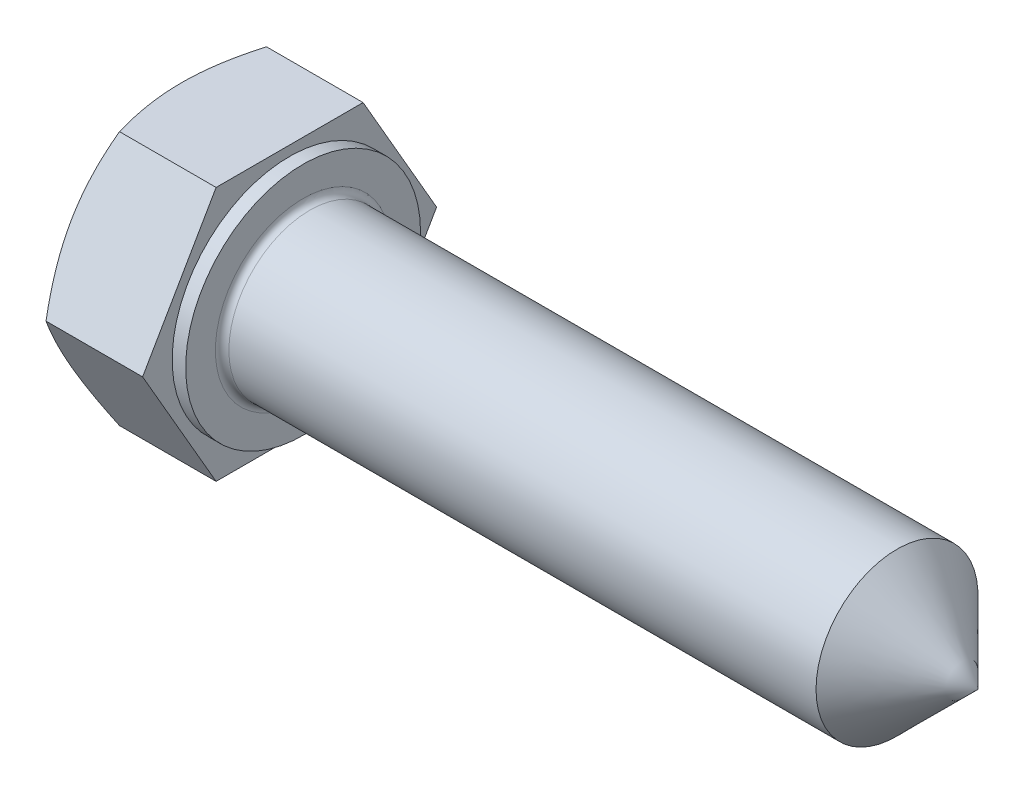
ISO-10303-21;
HEADER;
FILE_DESCRIPTION(('STEP AP214'),'2;1');
FILE_NAME('part.step','',(''),(''),'','','');
FILE_SCHEMA(('AUTOMOTIVE_DESIGN { 1 0 10303 214 1 1 1 1 }'));
ENDSEC;
DATA;
#1=APPLICATION_CONTEXT('core data for automotive mechanical design processes');
#2=APPLICATION_PROTOCOL_DEFINITION('international standard','automotive_design',2000,#1);
#3=PRODUCT_CONTEXT('',#1,'mechanical');
#4=PRODUCT('Part','Part','',(#3));
#5=PRODUCT_RELATED_PRODUCT_CATEGORY('part','',(#4));
#6=PRODUCT_DEFINITION_FORMATION('','',#4);
#7=PRODUCT_DEFINITION_CONTEXT('part definition',#1,'design');
#8=PRODUCT_DEFINITION('design','',#6,#7);
#9=PRODUCT_DEFINITION_SHAPE('','',#8);
#10=(LENGTH_UNIT() NAMED_UNIT(*) SI_UNIT(.MILLI.,.METRE.));
#11=(NAMED_UNIT(*) PLANE_ANGLE_UNIT() SI_UNIT($,.RADIAN.));
#12=(NAMED_UNIT(*) SI_UNIT($,.STERADIAN.) SOLID_ANGLE_UNIT());
#13=UNCERTAINTY_MEASURE_WITH_UNIT(LENGTH_MEASURE(1.E-05),#10,'distance_accuracy_value','');
#14=(GEOMETRIC_REPRESENTATION_CONTEXT(3) GLOBAL_UNCERTAINTY_ASSIGNED_CONTEXT((#13)) GLOBAL_UNIT_ASSIGNED_CONTEXT((#10,
#11,#12)) REPRESENTATION_CONTEXT('',''));
#15=CARTESIAN_POINT('',(0.,0.,0.));
#16=DIRECTION('',(0.,0.,1.));
#17=DIRECTION('',(1.,0.,0.));
#18=AXIS2_PLACEMENT_3D('',#15,#16,#17);
#19=CARTESIAN_POINT('',(29.5000000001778,0.,0.));
#20=DIRECTION('',(-1.,0.,0.));
#21=DIRECTION('',(0.,0.,1.));
#22=AXIS2_PLACEMENT_3D('',#19,#20,#21);
#23=CYLINDRICAL_SURFACE('',#22,3.);
#24=CARTESIAN_POINT('',(4.75000000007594,0.,0.));
#25=DIRECTION('',(1.,0.,0.));
#26=DIRECTION('',(0.,0.,-1.));
#27=AXIS2_PLACEMENT_3D('',#24,#25,#26);
#28=CIRCLE('',#27,3.);
#29=CARTESIAN_POINT('',(4.75000000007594,0.,-3.));
#30=VERTEX_POINT('',#29);
#31=EDGE_CURVE('E51',#30,#30,#28,.T.);
#32=ORIENTED_EDGE('',*,*,#31,.T.);
#33=EDGE_LOOP('',(#32));
#34=FACE_BOUND('',#33,.T.);
#35=CARTESIAN_POINT('',(26.5000000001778,0.,0.));
#36=DIRECTION('',(-1.,0.,0.));
#37=DIRECTION('',(0.,0.,1.));
#38=AXIS2_PLACEMENT_3D('',#35,#36,#37);
#39=CIRCLE('',#38,3.);
#40=CARTESIAN_POINT('',(26.5000000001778,0.,3.));
#41=VERTEX_POINT('',#40);
#42=EDGE_CURVE('E123',#41,#41,#39,.F.);
#43=ORIENTED_EDGE('',*,*,#42,.F.);
#44=EDGE_LOOP('',(#43));
#45=FACE_BOUND('',#44,.T.);
#46=ADVANCED_FACE('F43',(#34,#45),#23,.T.);
#47=CARTESIAN_POINT('',(4.50000000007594,0.,0.));
#48=DIRECTION('',(1.,0.,0.));
#49=DIRECTION('',(0.,0.,-1.));
#50=AXIS2_PLACEMENT_3D('',#47,#48,#49);
#51=PLANE('',#50);
#52=CARTESIAN_POINT('',(4.50000000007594,0.,0.));
#53=DIRECTION('',(1.,0.,0.));
#54=DIRECTION('',(0.,0.,-1.));
#55=AXIS2_PLACEMENT_3D('',#52,#53,#54);
#56=CIRCLE('',#55,3.25);
#57=CARTESIAN_POINT('',(4.50000000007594,0.,-3.25));
#58=VERTEX_POINT('',#57);
#59=EDGE_CURVE('E11',#58,#58,#56,.F.);
#60=ORIENTED_EDGE('',*,*,#59,.T.);
#61=EDGE_LOOP('',(#60));
#62=FACE_BOUND('',#61,.T.);
#63=CARTESIAN_POINT('',(4.50000000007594,0.,0.));
#64=DIRECTION('',(1.,0.,0.));
#65=DIRECTION('',(0.,0.,-1.));
#66=AXIS2_PLACEMENT_3D('',#63,#64,#65);
#67=CIRCLE('',#66,4.35);
#68=CARTESIAN_POINT('',(4.50000000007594,0.,-4.35));
#69=VERTEX_POINT('',#68);
#70=EDGE_CURVE('E183',#69,#69,#67,.T.);
#71=ORIENTED_EDGE('',*,*,#70,.T.);
#72=EDGE_LOOP('',(#71));
#73=FACE_BOUND('',#72,.T.);
#74=ADVANCED_FACE('F265',(#62,#73),#51,.T.);
#75=CARTESIAN_POINT('',(4.,-4.71550832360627,8.1675));
#76=DIRECTION('',(1.,0.,0.));
#77=DIRECTION('',(0.,0.,-1.));
#78=AXIS2_PLACEMENT_3D('',#75,#76,#77);
#79=PLANE('',#78);
#80=DIRECTION('',(0.,-0.866025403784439,0.5));
#81=VECTOR('',#80,1.);
#82=CARTESIAN_POINT('',(4.,4.71550832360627,2.7225));
#83=LINE('',#82,#81);
#84=CARTESIAN_POINT('',(4.,4.71550832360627,2.7225));
#85=VERTEX_POINT('',#84);
#86=CARTESIAN_POINT('',(4.,0.,5.445));
#87=VERTEX_POINT('',#86);
#88=EDGE_CURVE('E178',#85,#87,#83,.T.);
#89=ORIENTED_EDGE('',*,*,#88,.T.);
#90=DIRECTION('',(0.,-0.866025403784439,-0.5));
#91=VECTOR('',#90,1.);
#92=CARTESIAN_POINT('',(4.,0.,5.445));
#93=LINE('',#92,#91);
#94=CARTESIAN_POINT('',(4.,-4.71550832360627,2.7225));
#95=VERTEX_POINT('',#94);
#96=EDGE_CURVE('E176',#87,#95,#93,.T.);
#97=ORIENTED_EDGE('',*,*,#96,.T.);
#98=DIRECTION('',(0.,0.,-1.));
#99=VECTOR('',#98,1.);
#100=CARTESIAN_POINT('',(4.,-4.71550832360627,2.7225));
#101=LINE('',#100,#99);
#102=CARTESIAN_POINT('',(4.,-4.71550832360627,-2.7225));
#103=VERTEX_POINT('',#102);
#104=EDGE_CURVE('E171',#95,#103,#101,.T.);
#105=ORIENTED_EDGE('',*,*,#104,.T.);
#106=DIRECTION('',(0.,0.866025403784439,-0.5));
#107=VECTOR('',#106,1.);
#108=CARTESIAN_POINT('',(4.,-4.71550832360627,-2.7225));
#109=LINE('',#108,#107);
#110=CARTESIAN_POINT('',(4.,0.,-5.445));
#111=VERTEX_POINT('',#110);
#112=EDGE_CURVE('E175',#103,#111,#109,.T.);
#113=ORIENTED_EDGE('',*,*,#112,.T.);
#114=DIRECTION('',(0.,0.866025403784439,0.5));
#115=VECTOR('',#114,1.);
#116=CARTESIAN_POINT('',(4.,0.,-5.445));
#117=LINE('',#116,#115);
#118=CARTESIAN_POINT('',(4.,4.71550832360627,-2.7225));
#119=VERTEX_POINT('',#118);
#120=EDGE_CURVE('E169',#111,#119,#117,.T.);
#121=ORIENTED_EDGE('',*,*,#120,.T.);
#122=DIRECTION('',(0.,0.,1.));
#123=VECTOR('',#122,1.);
#124=CARTESIAN_POINT('',(4.,4.71550832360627,-2.7225));
#125=LINE('',#124,#123);
#126=EDGE_CURVE('E168',#119,#85,#125,.T.);
#127=ORIENTED_EDGE('',*,*,#126,.T.);
#128=EDGE_LOOP('',(#89,#97,#105,#113,#121,#127));
#129=FACE_BOUND('',#128,.T.);
#130=CARTESIAN_POINT('',(4.00000000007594,0.,0.));
#131=DIRECTION('',(1.,0.,0.));
#132=DIRECTION('',(0.,0.,-1.));
#133=AXIS2_PLACEMENT_3D('',#130,#131,#132);
#134=CIRCLE('',#133,4.35);
#135=CARTESIAN_POINT('',(4.00000000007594,0.,-4.35));
#136=VERTEX_POINT('',#135);
#137=EDGE_CURVE('E182',#136,#136,#134,.T.);
#138=ORIENTED_EDGE('',*,*,#137,.F.);
#139=EDGE_LOOP('',(#138));
#140=FACE_BOUND('',#139,.T.);
#141=ADVANCED_FACE('F260',(#129,#140),#79,.T.);
#142=CARTESIAN_POINT('',(4.,4.71550832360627,2.7225));
#143=DIRECTION('',(0.,-0.5,-0.866025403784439));
#144=DIRECTION('',(0.,0.866025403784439,-0.5));
#145=AXIS2_PLACEMENT_3D('',#142,#143,#144);
#146=PLANE('',#145);
#147=DIRECTION('',(-1.,0.,0.));
#148=VECTOR('',#147,1.);
#149=CARTESIAN_POINT('',(4.,4.71550832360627,2.7225));
#150=LINE('',#149,#148);
#151=CARTESIAN_POINT('',(0.421172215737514,4.71550832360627,2.7225));
#152=VERTEX_POINT('',#151);
#153=EDGE_CURVE('E163',#85,#152,#150,.T.);
#154=ORIENTED_EDGE('',*,*,#153,.T.);
#155=CARTESIAN_POINT('',(0.421238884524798,4.71570832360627,2.72238452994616));
#156=CARTESIAN_POINT('',(0.352144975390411,4.50847606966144,2.84203012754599));
#157=CARTESIAN_POINT('',(0.289300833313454,4.29947135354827,2.96269905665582));
#158=CARTESIAN_POINT('',(0.179605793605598,3.87784281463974,3.20612640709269));
#159=CARTESIAN_POINT('',(0.13279369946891,3.66521150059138,3.32888915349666));
#160=CARTESIAN_POINT('',(0.0599364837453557,3.24255163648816,3.5729119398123));
#161=CARTESIAN_POINT('',(0.033406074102,3.03258890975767,3.69413397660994));
#162=CARTESIAN_POINT('',(0.00961539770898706,2.71690623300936,3.87639345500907));
#163=CARTESIAN_POINT('',(0.00435134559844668,2.61160665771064,3.93718819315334));
#164=CARTESIAN_POINT('',(-0.000752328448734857,2.40091018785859,4.05883385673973));
#165=CARTESIAN_POINT('',(-0.000592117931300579,2.29551329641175,4.11968478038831));
#166=CARTESIAN_POINT('',(0.0073120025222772,2.00675377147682,4.28640016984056));
#167=CARTESIAN_POINT('',(0.020587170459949,1.82348681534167,4.39220939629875));
#168=CARTESIAN_POINT('',(0.0626831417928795,1.45816922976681,4.60312560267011));
#169=CARTESIAN_POINT('',(0.0915183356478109,1.27611988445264,4.70823184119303));
#170=CARTESIAN_POINT('',(0.16359904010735,0.910066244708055,4.91957300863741));
#171=CARTESIAN_POINT('',(0.207149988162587,0.726108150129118,5.02578126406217));
#172=CARTESIAN_POINT('',(0.305993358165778,0.360935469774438,5.23661380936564));
#173=CARTESIAN_POINT('',(0.361262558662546,0.179716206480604,5.34124079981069));
#174=CARTESIAN_POINT('',(0.421238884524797,-0.000200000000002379,5.44511547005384));
#175=B_SPLINE_CURVE_WITH_KNOTS('',3,(#155,#156,#157,#158,#159,#160,#161,#162,#163,#164,#165,
#166,#167,#168,#169,#170,#171,#172,#173,#174),.UNSPECIFIED.,.F.,.F.,(4,2,2,2,2,2,2,2,2,4),(0.,
0.74746163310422,1.49671982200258,2.22743464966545,2.59243933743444,2.95743275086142,
3.59287164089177,4.2288992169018,4.87903398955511,5.52789226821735),.UNSPECIFIED.);
#176=CARTESIAN_POINT('',(0.,2.35775416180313,4.08375));
#177=VERTEX_POINT('',#176);
#178=EDGE_CURVE('E66',#152,#177,#175,.T.);
#179=ORIENTED_EDGE('',*,*,#178,.T.);
#180=CARTESIAN_POINT('',(0.421172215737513,0.,5.445));
#181=VERTEX_POINT('',#180);
#182=EDGE_CURVE('E186',#177,#181,#175,.T.);
#183=ORIENTED_EDGE('',*,*,#182,.T.);
#184=DIRECTION('',(-1.,0.,0.));
#185=VECTOR('',#184,1.);
#186=CARTESIAN_POINT('',(4.,0.,5.445));
#187=LINE('',#186,#185);
#188=EDGE_CURVE('E143',#87,#181,#187,.T.);
#189=ORIENTED_EDGE('',*,*,#188,.F.);
#190=ORIENTED_EDGE('',*,*,#88,.F.);
#191=EDGE_LOOP('',(#154,#179,#183,#189,#190));
#192=FACE_BOUND('',#191,.T.);
#193=ADVANCED_FACE('F203',(#192),#146,.F.);
#194=CARTESIAN_POINT('',(4.,0.,5.445));
#195=DIRECTION('',(0.,0.5,-0.866025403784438));
#196=DIRECTION('',(0.,0.866025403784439,0.5));
#197=AXIS2_PLACEMENT_3D('',#194,#195,#196);
#198=PLANE('',#197);
#199=ORIENTED_EDGE('',*,*,#188,.T.);
#200=CARTESIAN_POINT('',(0.421238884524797,0.000199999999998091,5.44511547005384));
#201=CARTESIAN_POINT('',(0.35214497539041,-0.207032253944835,5.32546987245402));
#202=CARTESIAN_POINT('',(0.289300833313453,-0.416036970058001,5.20480094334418));
#203=CARTESIAN_POINT('',(0.179605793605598,-0.837665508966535,4.96137359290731));
#204=CARTESIAN_POINT('',(0.13279369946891,-1.05029682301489,4.83861084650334));
#205=CARTESIAN_POINT('',(0.0599364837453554,-1.47295668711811,4.5945880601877));
#206=CARTESIAN_POINT('',(0.033406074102,-1.6829194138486,4.47336602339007));
#207=CARTESIAN_POINT('',(0.00961539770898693,-1.99860209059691,4.29110654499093));
#208=CARTESIAN_POINT('',(0.00435134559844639,-2.10390166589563,4.23031180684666));
#209=CARTESIAN_POINT('',(-0.000752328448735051,-2.31459813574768,4.10866614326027));
#210=CARTESIAN_POINT('',(-0.000592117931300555,-2.41999502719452,4.04781521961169));
#211=CARTESIAN_POINT('',(0.00731200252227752,-2.70875455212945,3.88109983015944));
#212=CARTESIAN_POINT('',(0.0205871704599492,-2.8920215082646,3.77529060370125));
#213=CARTESIAN_POINT('',(0.0626831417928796,-3.25733909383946,3.5643743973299));
#214=CARTESIAN_POINT('',(0.0915183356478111,-3.43938843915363,3.45926815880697));
#215=CARTESIAN_POINT('',(0.16359904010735,-3.80544207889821,3.24792699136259));
#216=CARTESIAN_POINT('',(0.207149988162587,-3.98940017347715,3.14171873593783));
#217=CARTESIAN_POINT('',(0.305993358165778,-4.35457285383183,2.93088619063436));
#218=CARTESIAN_POINT('',(0.361262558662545,-4.53579211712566,2.82625920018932));
#219=CARTESIAN_POINT('',(0.421238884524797,-4.71570832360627,2.72238452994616));
#220=B_SPLINE_CURVE_WITH_KNOTS('',3,(#200,#201,#202,#203,#204,#205,#206,#207,#208,#209,#210,
#211,#212,#213,#214,#215,#216,#217,#218,#219),.UNSPECIFIED.,.F.,.F.,(4,2,2,2,2,2,2,2,2,4),(0.,
0.74746163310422,1.49671982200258,2.22743464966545,2.59243933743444,2.95743275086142,
3.59287164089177,4.2288992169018,4.87903398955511,5.52789226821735),.UNSPECIFIED.);
#221=CARTESIAN_POINT('',(0.,-2.35775416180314,4.08375));
#222=VERTEX_POINT('',#221);
#223=EDGE_CURVE('E196',#181,#222,#220,.T.);
#224=ORIENTED_EDGE('',*,*,#223,.T.);
#225=CARTESIAN_POINT('',(0.421172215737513,-4.71550832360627,2.7225));
#226=VERTEX_POINT('',#225);
#227=EDGE_CURVE('E200',#222,#226,#220,.T.);
#228=ORIENTED_EDGE('',*,*,#227,.T.);
#229=DIRECTION('',(-1.,0.,0.));
#230=VECTOR('',#229,1.);
#231=CARTESIAN_POINT('',(4.,-4.71550832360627,2.7225));
#232=LINE('',#231,#230);
#233=EDGE_CURVE('E146',#95,#226,#232,.T.);
#234=ORIENTED_EDGE('',*,*,#233,.F.);
#235=ORIENTED_EDGE('',*,*,#96,.F.);
#236=EDGE_LOOP('',(#199,#224,#228,#234,#235));
#237=FACE_BOUND('',#236,.T.);
#238=ADVANCED_FACE('F251',(#237),#198,.F.);
#239=CARTESIAN_POINT('',(4.,-4.71550832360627,2.7225));
#240=DIRECTION('',(0.,1.,0.));
#241=DIRECTION('',(0.,0.,1.));
#242=AXIS2_PLACEMENT_3D('',#239,#240,#241);
#243=PLANE('',#242);
#244=ORIENTED_EDGE('',*,*,#233,.T.);
#245=CARTESIAN_POINT('',(2.25649666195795,-4.71550832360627,-7.22047121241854));
#246=CARTESIAN_POINT('',(2.15644471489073,-4.71550832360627,-7.01343373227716));
#247=CARTESIAN_POINT('',(2.05738736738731,-4.71550832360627,-6.80590674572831));
#248=CARTESIAN_POINT('',(1.86183021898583,-4.71550832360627,-6.38960908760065));
#249=CARTESIAN_POINT('',(1.76533086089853,-4.71550832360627,-6.18083820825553));
#250=CARTESIAN_POINT('',(1.57494967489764,-4.71550832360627,-5.76066032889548));
#251=CARTESIAN_POINT('',(1.48108598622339,-4.71550832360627,-5.54924508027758));
#252=CARTESIAN_POINT('',(1.29739028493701,-4.71550832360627,-5.12467692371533));
#253=CARTESIAN_POINT('',(1.20755806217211,-4.71550832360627,-4.91152410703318));
#254=CARTESIAN_POINT('',(1.0319308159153,-4.71550832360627,-4.4804957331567));
#255=CARTESIAN_POINT('',(0.946198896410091,-4.71550832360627,-4.26259432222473));
#256=CARTESIAN_POINT('',(0.781449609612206,-4.71550832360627,-3.82422116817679));
#257=CARTESIAN_POINT('',(0.702432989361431,-4.71550832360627,-3.60374914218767));
#258=CARTESIAN_POINT('',(0.55323723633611,-4.71550832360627,-3.16033760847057));
#259=CARTESIAN_POINT('',(0.48303931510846,-4.71550832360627,-2.93740448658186));
#260=CARTESIAN_POINT('',(0.353761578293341,-4.71550832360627,-2.48836664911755));
#261=CARTESIAN_POINT('',(0.294678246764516,-4.71550832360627,-2.26226296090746));
#262=CARTESIAN_POINT('',(0.190494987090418,-4.71550832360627,-1.80674044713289));
#263=CARTESIAN_POINT('',(0.145398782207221,-4.71550832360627,-1.5773207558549));
#264=CARTESIAN_POINT('',(0.0722373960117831,-4.71550832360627,-1.11568323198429));
#265=CARTESIAN_POINT('',(0.0441722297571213,-4.71550832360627,-0.883465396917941));
#266=CARTESIAN_POINT('',(0.0166468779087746,-4.71550832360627,-0.534769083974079));
#267=CARTESIAN_POINT('',(0.00989909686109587,-4.71550832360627,-0.418836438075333));
#268=CARTESIAN_POINT('',(0.0013160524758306,-4.71550832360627,-0.18678412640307));
#269=CARTESIAN_POINT('',(-0.000519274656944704,-4.71550832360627,-0.0706644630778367));
#270=CARTESIAN_POINT('',(0.000771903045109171,-4.71550832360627,0.161513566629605));
#271=CARTESIAN_POINT('',(0.00389700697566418,-4.71550832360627,0.277571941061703));
#272=CARTESIAN_POINT('',(0.0150297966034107,-4.71550832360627,0.509456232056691));
#273=CARTESIAN_POINT('',(0.0230377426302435,-4.71550832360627,0.625282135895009));
#274=CARTESIAN_POINT('',(0.0481985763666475,-4.71550832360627,0.906021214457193));
#275=CARTESIAN_POINT('',(0.0677988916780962,-4.71550832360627,1.07071928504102));
#276=CARTESIAN_POINT('',(0.115780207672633,-4.71550832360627,1.39882177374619));
#277=CARTESIAN_POINT('',(0.144162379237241,-4.71550832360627,1.56222601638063));
#278=CARTESIAN_POINT('',(0.240981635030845,-4.71550832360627,2.05040601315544));
#279=CARTESIAN_POINT('',(0.32106611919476,-4.71550832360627,2.37289840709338));
#280=CARTESIAN_POINT('',(0.45919177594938,-4.71550832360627,2.85545581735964));
#281=CARTESIAN_POINT('',(0.508937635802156,-4.71550832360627,3.0180378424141));
#282=CARTESIAN_POINT('',(0.613351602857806,-4.71550832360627,3.34150529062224));
#283=CARTESIAN_POINT('',(0.66801631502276,-4.71550832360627,3.5023917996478));
#284=CARTESIAN_POINT('',(0.781130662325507,-4.71550832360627,3.82179503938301));
#285=CARTESIAN_POINT('',(0.839557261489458,-4.71550832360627,3.98032001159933));
#286=CARTESIAN_POINT('',(0.959839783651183,-4.71550832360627,4.29614001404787));
#287=CARTESIAN_POINT('',(1.02169709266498,-4.71550832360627,4.45343451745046));
#288=CARTESIAN_POINT('',(1.08493119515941,-4.71550832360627,4.61016031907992));
#289=B_SPLINE_CURVE_WITH_KNOTS('',3,(#245,#246,#247,#248,#249,#250,#251,#252,#253,#254,#255,
#256,#257,#258,#259,#260,#261,#262,#263,#264,#265,#266,#267,#268,#269,#270,#271,#272,#273,#274,
#275,#276,#277,#278,#279,#280,#281,#282,#283,#284,#285,#286,#287,#288),.UNSPECIFIED.,.F.,.F.,(4,
2,2,2,2,2,2,2,2,2,2,2,2,2,2,2,2,2,2,2,2,4),(0.,0.689845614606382,1.37980987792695,
2.073722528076,2.76759896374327,3.46999404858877,4.17246716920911,4.87341731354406,
5.57414534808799,6.27505975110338,6.97597477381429,7.3242729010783,7.67256650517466,
8.02076176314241,8.36897558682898,8.86627362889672,9.36363800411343,10.3591191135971,
10.8691460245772,11.3788235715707,11.8856323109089,12.3926473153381),.UNSPECIFIED.);
#290=CARTESIAN_POINT('',(0.,-4.71550832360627,0.));
#291=VERTEX_POINT('',#290);
#292=EDGE_CURVE('E244',#226,#291,#289,.F.);
#293=ORIENTED_EDGE('',*,*,#292,.T.);
#294=CARTESIAN_POINT('',(0.421172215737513,-4.71550832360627,-2.7225));
#295=VERTEX_POINT('',#294);
#296=EDGE_CURVE('E239',#291,#295,#289,.F.);
#297=ORIENTED_EDGE('',*,*,#296,.T.);
#298=DIRECTION('',(-1.,0.,0.));
#299=VECTOR('',#298,1.);
#300=CARTESIAN_POINT('',(4.,-4.71550832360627,-2.7225));
#301=LINE('',#300,#299);
#302=EDGE_CURVE('E152',#103,#295,#301,.T.);
#303=ORIENTED_EDGE('',*,*,#302,.F.);
#304=ORIENTED_EDGE('',*,*,#104,.F.);
#305=EDGE_LOOP('',(#244,#293,#297,#303,#304));
#306=FACE_BOUND('',#305,.T.);
#307=ADVANCED_FACE('F250',(#306),#243,.F.);
#308=CARTESIAN_POINT('',(4.,-4.71550832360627,-2.7225));
#309=DIRECTION('',(0.,0.5,0.866025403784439));
#310=DIRECTION('',(0.,-0.866025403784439,0.5));
#311=AXIS2_PLACEMENT_3D('',#308,#309,#310);
#312=PLANE('',#311);
#313=ORIENTED_EDGE('',*,*,#302,.T.);
#314=CARTESIAN_POINT('',(0.421238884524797,-4.71570832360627,-2.72238452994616));
#315=CARTESIAN_POINT('',(0.35214497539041,-4.50847606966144,-2.84203012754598));
#316=CARTESIAN_POINT('',(0.289300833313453,-4.29947135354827,-2.96269905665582));
#317=CARTESIAN_POINT('',(0.179605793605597,-3.87784281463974,-3.20612640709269));
#318=CARTESIAN_POINT('',(0.132793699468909,-3.66521150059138,-3.32888915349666));
#319=CARTESIAN_POINT('',(0.0599364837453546,-3.24255163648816,-3.5729119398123));
#320=CARTESIAN_POINT('',(0.0334060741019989,-3.03258890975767,-3.69413397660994));
#321=CARTESIAN_POINT('',(0.00961539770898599,-2.71690623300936,-3.87639345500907));
#322=CARTESIAN_POINT('',(0.00435134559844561,-2.61160665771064,-3.93718819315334));
#323=CARTESIAN_POINT('',(-0.000752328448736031,-2.40091018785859,-4.05883385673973));
#324=CARTESIAN_POINT('',(-0.000592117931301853,-2.29551329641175,-4.11968478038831));
#325=CARTESIAN_POINT('',(0.00731200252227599,-2.00675377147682,-4.28640016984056));
#326=CARTESIAN_POINT('',(0.0205871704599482,-1.82348681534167,-4.39220939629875));
#327=CARTESIAN_POINT('',(0.062683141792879,-1.45816922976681,-4.6031256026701));
#328=CARTESIAN_POINT('',(0.0915183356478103,-1.27611988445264,-4.70823184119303));
#329=CARTESIAN_POINT('',(0.163599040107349,-0.910066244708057,-4.91957300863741));
#330=CARTESIAN_POINT('',(0.207149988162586,-0.726108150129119,-5.02578126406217));
#331=CARTESIAN_POINT('',(0.305993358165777,-0.360935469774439,-5.23661380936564));
#332=CARTESIAN_POINT('',(0.361262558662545,-0.179716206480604,-5.34124079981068));
#333=CARTESIAN_POINT('',(0.421238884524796,0.00020000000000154,-5.44511547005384));
#334=B_SPLINE_CURVE_WITH_KNOTS('',3,(#314,#315,#316,#317,#318,#319,#320,#321,#322,#323,#324,
#325,#326,#327,#328,#329,#330,#331,#332,#333),.UNSPECIFIED.,.F.,.F.,(4,2,2,2,2,2,2,2,2,4),(0.,
0.74746163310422,1.49671982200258,2.22743464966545,2.59243933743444,2.95743275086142,
3.59287164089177,4.2288992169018,4.87903398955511,5.52789226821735),.UNSPECIFIED.);
#335=CARTESIAN_POINT('',(0.,-2.35775416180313,-4.08375));
#336=VERTEX_POINT('',#335);
#337=EDGE_CURVE('E247',#295,#336,#334,.T.);
#338=ORIENTED_EDGE('',*,*,#337,.T.);
#339=CARTESIAN_POINT('',(0.421172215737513,0.,-5.445));
#340=VERTEX_POINT('',#339);
#341=EDGE_CURVE('E235',#336,#340,#334,.T.);
#342=ORIENTED_EDGE('',*,*,#341,.T.);
#343=DIRECTION('',(-1.,0.,0.));
#344=VECTOR('',#343,1.);
#345=CARTESIAN_POINT('',(4.,0.,-5.445));
#346=LINE('',#345,#344);
#347=EDGE_CURVE('E159',#111,#340,#346,.T.);
#348=ORIENTED_EDGE('',*,*,#347,.F.);
#349=ORIENTED_EDGE('',*,*,#112,.F.);
#350=EDGE_LOOP('',(#313,#338,#342,#348,#349));
#351=FACE_BOUND('',#350,.T.);
#352=ADVANCED_FACE('F248',(#351),#312,.F.);
#353=CARTESIAN_POINT('',(4.,0.,-5.445));
#354=DIRECTION('',(0.,-0.5,0.866025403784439));
#355=DIRECTION('',(0.,-0.866025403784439,-0.5));
#356=AXIS2_PLACEMENT_3D('',#353,#354,#355);
#357=PLANE('',#356);
#358=ORIENTED_EDGE('',*,*,#347,.T.);
#359=CARTESIAN_POINT('',(0.421238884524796,-0.000199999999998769,-5.44511547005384));
#360=CARTESIAN_POINT('',(0.352144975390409,0.207032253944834,-5.32546987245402));
#361=CARTESIAN_POINT('',(0.289300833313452,0.416036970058,-5.20480094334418));
#362=CARTESIAN_POINT('',(0.179605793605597,0.837665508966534,-4.96137359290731));
#363=CARTESIAN_POINT('',(0.132793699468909,1.05029682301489,-4.83861084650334));
#364=CARTESIAN_POINT('',(0.0599364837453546,1.47295668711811,-4.5945880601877));
#365=CARTESIAN_POINT('',(0.0334060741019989,1.6829194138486,-4.47336602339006));
#366=CARTESIAN_POINT('',(0.0096153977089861,1.99860209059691,-4.29110654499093));
#367=CARTESIAN_POINT('',(0.00435134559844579,2.10390166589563,-4.23031180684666));
#368=CARTESIAN_POINT('',(-0.000752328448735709,2.31459813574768,-4.10866614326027));
#369=CARTESIAN_POINT('',(-0.000592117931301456,2.41999502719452,-4.04781521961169));
#370=CARTESIAN_POINT('',(0.00731200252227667,2.70875455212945,-3.88109983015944));
#371=CARTESIAN_POINT('',(0.0205871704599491,2.8920215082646,-3.77529060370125));
#372=CARTESIAN_POINT('',(0.0626831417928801,3.25733909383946,-3.5643743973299));
#373=CARTESIAN_POINT('',(0.0915183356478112,3.43938843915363,-3.45926815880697));
#374=CARTESIAN_POINT('',(0.16359904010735,3.80544207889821,-3.24792699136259));
#375=CARTESIAN_POINT('',(0.207149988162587,3.98940017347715,-3.14171873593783));
#376=CARTESIAN_POINT('',(0.305993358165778,4.35457285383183,-2.93088619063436));
#377=CARTESIAN_POINT('',(0.361262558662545,4.53579211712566,-2.82625920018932));
#378=CARTESIAN_POINT('',(0.421238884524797,4.71570832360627,-2.72238452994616));
#379=B_SPLINE_CURVE_WITH_KNOTS('',3,(#359,#360,#361,#362,#363,#364,#365,#366,#367,#368,#369,
#370,#371,#372,#373,#374,#375,#376,#377,#378),.UNSPECIFIED.,.F.,.F.,(4,2,2,2,2,2,2,2,2,4),(0.,
0.747461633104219,1.49671982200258,2.22743464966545,2.59243933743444,2.95743275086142,
3.59287164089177,4.2288992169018,4.87903398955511,5.52789226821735),.UNSPECIFIED.);
#380=CARTESIAN_POINT('',(0.,2.35775416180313,-4.08375));
#381=VERTEX_POINT('',#380);
#382=EDGE_CURVE('E300',#340,#381,#379,.T.);
#383=ORIENTED_EDGE('',*,*,#382,.T.);
#384=CARTESIAN_POINT('',(0.421172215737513,4.71550832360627,-2.7225));
#385=VERTEX_POINT('',#384);
#386=EDGE_CURVE('E221',#381,#385,#379,.T.);
#387=ORIENTED_EDGE('',*,*,#386,.T.);
#388=DIRECTION('',(-1.,0.,0.));
#389=VECTOR('',#388,1.);
#390=CARTESIAN_POINT('',(4.,4.71550832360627,-2.7225));
#391=LINE('',#390,#389);
#392=EDGE_CURVE('E165',#119,#385,#391,.T.);
#393=ORIENTED_EDGE('',*,*,#392,.F.);
#394=ORIENTED_EDGE('',*,*,#120,.F.);
#395=EDGE_LOOP('',(#358,#383,#387,#393,#394));
#396=FACE_BOUND('',#395,.T.);
#397=ADVANCED_FACE('F281',(#396),#357,.F.);
#398=CARTESIAN_POINT('',(4.,4.71550832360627,-2.7225));
#399=DIRECTION('',(0.,-1.,0.));
#400=DIRECTION('',(0.,0.,-1.));
#401=AXIS2_PLACEMENT_3D('',#398,#399,#400);
#402=PLANE('',#401);
#403=ORIENTED_EDGE('',*,*,#392,.T.);
#404=CARTESIAN_POINT('',(2.25649666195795,4.71550832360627,-7.22047121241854));
#405=CARTESIAN_POINT('',(2.15644471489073,4.71550832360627,-7.01343373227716));
#406=CARTESIAN_POINT('',(2.05738736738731,4.71550832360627,-6.80590674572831));
#407=CARTESIAN_POINT('',(1.86183021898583,4.71550832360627,-6.38960908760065));
#408=CARTESIAN_POINT('',(1.76533086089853,4.71550832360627,-6.18083820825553));
#409=CARTESIAN_POINT('',(1.57494967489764,4.71550832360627,-5.76066032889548));
#410=CARTESIAN_POINT('',(1.48108598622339,4.71550832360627,-5.54924508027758));
#411=CARTESIAN_POINT('',(1.29739028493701,4.71550832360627,-5.12467692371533));
#412=CARTESIAN_POINT('',(1.20755806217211,4.71550832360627,-4.91152410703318));
#413=CARTESIAN_POINT('',(1.0319308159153,4.71550832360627,-4.4804957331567));
#414=CARTESIAN_POINT('',(0.946198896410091,4.71550832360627,-4.26259432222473));
#415=CARTESIAN_POINT('',(0.781449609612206,4.71550832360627,-3.82422116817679));
#416=CARTESIAN_POINT('',(0.702432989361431,4.71550832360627,-3.60374914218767));
#417=CARTESIAN_POINT('',(0.55323723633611,4.71550832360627,-3.16033760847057));
#418=CARTESIAN_POINT('',(0.48303931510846,4.71550832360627,-2.93740448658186));
#419=CARTESIAN_POINT('',(0.353761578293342,4.71550832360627,-2.48836664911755));
#420=CARTESIAN_POINT('',(0.294678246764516,4.71550832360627,-2.26226296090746));
#421=CARTESIAN_POINT('',(0.190494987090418,4.71550832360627,-1.80674044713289));
#422=CARTESIAN_POINT('',(0.145398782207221,4.71550832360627,-1.5773207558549));
#423=CARTESIAN_POINT('',(0.0722373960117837,4.71550832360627,-1.11568323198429));
#424=CARTESIAN_POINT('',(0.0441722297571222,4.71550832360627,-0.883465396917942));
#425=CARTESIAN_POINT('',(0.0166468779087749,4.71550832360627,-0.53476908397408));
#426=CARTESIAN_POINT('',(0.00989909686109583,4.71550832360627,-0.418836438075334));
#427=CARTESIAN_POINT('',(0.00131605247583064,4.71550832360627,-0.186784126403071));
#428=CARTESIAN_POINT('',(-0.000519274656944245,4.71550832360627,-0.0706644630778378));
#429=CARTESIAN_POINT('',(0.000771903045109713,4.71550832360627,0.161513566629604));
#430=CARTESIAN_POINT('',(0.00389700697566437,4.71550832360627,0.277571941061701));
#431=CARTESIAN_POINT('',(0.0150297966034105,4.71550832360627,0.50945623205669));
#432=CARTESIAN_POINT('',(0.0230377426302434,4.71550832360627,0.625282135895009));
#433=CARTESIAN_POINT('',(0.0481985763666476,4.71550832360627,0.906021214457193));
#434=CARTESIAN_POINT('',(0.0677988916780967,4.71550832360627,1.07071928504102));
#435=CARTESIAN_POINT('',(0.115780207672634,4.71550832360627,1.39882177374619));
#436=CARTESIAN_POINT('',(0.144162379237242,4.71550832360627,1.56222601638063));
#437=CARTESIAN_POINT('',(0.240981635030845,4.71550832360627,2.05040601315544));
#438=CARTESIAN_POINT('',(0.321066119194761,4.71550832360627,2.37289840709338));
#439=CARTESIAN_POINT('',(0.459191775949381,4.71550832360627,2.85545581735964));
#440=CARTESIAN_POINT('',(0.508937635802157,4.71550832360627,3.0180378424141));
#441=CARTESIAN_POINT('',(0.613351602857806,4.71550832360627,3.34150529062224));
#442=CARTESIAN_POINT('',(0.66801631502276,4.71550832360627,3.5023917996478));
#443=CARTESIAN_POINT('',(0.781130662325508,4.71550832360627,3.82179503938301));
#444=CARTESIAN_POINT('',(0.839557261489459,4.71550832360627,3.98032001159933));
#445=CARTESIAN_POINT('',(0.959839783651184,4.71550832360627,4.29614001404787));
#446=CARTESIAN_POINT('',(1.02169709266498,4.71550832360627,4.45343451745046));
#447=CARTESIAN_POINT('',(1.08493119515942,4.71550832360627,4.61016031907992));
#448=B_SPLINE_CURVE_WITH_KNOTS('',3,(#404,#405,#406,#407,#408,#409,#410,#411,#412,#413,#414,
#415,#416,#417,#418,#419,#420,#421,#422,#423,#424,#425,#426,#427,#428,#429,#430,#431,#432,#433,
#434,#435,#436,#437,#438,#439,#440,#441,#442,#443,#444,#445,#446,#447),.UNSPECIFIED.,.F.,.F.,(4,
2,2,2,2,2,2,2,2,2,2,2,2,2,2,2,2,2,2,2,2,4),(0.,0.689845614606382,1.37980987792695,
2.073722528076,2.76759896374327,3.46999404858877,4.17246716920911,4.87341731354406,
5.57414534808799,6.27505975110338,6.97597477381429,7.3242729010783,7.67256650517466,
8.0207617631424,8.36897558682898,8.86627362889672,9.36363800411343,10.3591191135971,
10.8691460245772,11.3788235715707,11.8856323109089,12.3926473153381),.UNSPECIFIED.);
#449=CARTESIAN_POINT('',(0.,4.71550832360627,0.));
#450=VERTEX_POINT('',#449);
#451=EDGE_CURVE('E305',#385,#450,#448,.T.);
#452=ORIENTED_EDGE('',*,*,#451,.T.);
#453=EDGE_CURVE('E127',#450,#152,#448,.T.);
#454=ORIENTED_EDGE('',*,*,#453,.T.);
#455=ORIENTED_EDGE('',*,*,#153,.F.);
#456=ORIENTED_EDGE('',*,*,#126,.F.);
#457=EDGE_LOOP('',(#403,#452,#454,#455,#456));
#458=FACE_BOUND('',#457,.T.);
#459=ADVANCED_FACE('F280',(#458),#402,.F.);
#460=CARTESIAN_POINT('',(4.50000000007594,0.,0.));
#461=DIRECTION('',(-1.,0.,0.));
#462=DIRECTION('',(0.,0.,1.));
#463=AXIS2_PLACEMENT_3D('',#460,#461,#462);
#464=CYLINDRICAL_SURFACE('',#463,4.35);
#465=ORIENTED_EDGE('',*,*,#70,.F.);
#466=EDGE_LOOP('',(#465));
#467=FACE_BOUND('',#466,.T.);
#468=ORIENTED_EDGE('',*,*,#137,.T.);
#469=EDGE_LOOP('',(#468));
#470=FACE_BOUND('',#469,.T.);
#471=ADVANCED_FACE('F272',(#467,#470),#464,.T.);
#472=CARTESIAN_POINT('',(0.,0.,0.));
#473=DIRECTION('',(1.,0.,0.));
#474=DIRECTION('',(0.,0.,-1.));
#475=AXIS2_PLACEMENT_3D('',#472,#473,#474);
#476=CONICAL_SURFACE('',#475,4.71550832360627,1.0471975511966);
#477=CARTESIAN_POINT('',(0.,0.,0.));
#478=DIRECTION('',(1.,0.,0.));
#479=DIRECTION('',(0.,0.,-1.));
#480=AXIS2_PLACEMENT_3D('',#477,#478,#479);
#481=CIRCLE('',#480,4.71550832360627);
#482=EDGE_CURVE('E132',#381,#336,#481,.F.);
#483=ORIENTED_EDGE('',*,*,#482,.F.);
#484=ORIENTED_EDGE('',*,*,#382,.F.);
#485=ORIENTED_EDGE('',*,*,#341,.F.);
#486=EDGE_LOOP('',(#483,#484,#485));
#487=FACE_BOUND('',#486,.T.);
#488=ADVANCED_FACE('F276',(#487),#476,.T.);
#489=CARTESIAN_POINT('',(0.,0.,0.));
#490=DIRECTION('',(1.,0.,0.));
#491=DIRECTION('',(0.,0.,-1.));
#492=AXIS2_PLACEMENT_3D('',#489,#490,#491);
#493=CIRCLE('',#492,4.71550832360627);
#494=EDGE_CURVE('E124',#381,#450,#493,.T.);
#495=ORIENTED_EDGE('',*,*,#494,.T.);
#496=ORIENTED_EDGE('',*,*,#451,.F.);
#497=ORIENTED_EDGE('',*,*,#386,.F.);
#498=EDGE_LOOP('',(#495,#496,#497));
#499=FACE_BOUND('',#498,.T.);
#500=ADVANCED_FACE('F212',(#499),#476,.T.);
#501=ORIENTED_EDGE('',*,*,#453,.F.);
#502=EDGE_CURVE('E145',#177,#450,#481,.F.);
#503=ORIENTED_EDGE('',*,*,#502,.F.);
#504=ORIENTED_EDGE('',*,*,#178,.F.);
#505=EDGE_LOOP('',(#501,#503,#504));
#506=FACE_BOUND('',#505,.T.);
#507=ADVANCED_FACE('F207',(#506),#476,.T.);
#508=EDGE_CURVE('E141',#222,#177,#481,.F.);
#509=ORIENTED_EDGE('',*,*,#508,.F.);
#510=ORIENTED_EDGE('',*,*,#223,.F.);
#511=ORIENTED_EDGE('',*,*,#182,.F.);
#512=EDGE_LOOP('',(#509,#510,#511));
#513=FACE_BOUND('',#512,.T.);
#514=ADVANCED_FACE('F208',(#513),#476,.T.);
#515=EDGE_CURVE('E137',#291,#222,#481,.F.);
#516=ORIENTED_EDGE('',*,*,#515,.F.);
#517=ORIENTED_EDGE('',*,*,#292,.F.);
#518=ORIENTED_EDGE('',*,*,#227,.F.);
#519=EDGE_LOOP('',(#516,#517,#518));
#520=FACE_BOUND('',#519,.T.);
#521=ADVANCED_FACE('F314',(#520),#476,.T.);
#522=EDGE_CURVE('E59',#336,#291,#481,.F.);
#523=ORIENTED_EDGE('',*,*,#522,.F.);
#524=ORIENTED_EDGE('',*,*,#337,.F.);
#525=ORIENTED_EDGE('',*,*,#296,.F.);
#526=EDGE_LOOP('',(#523,#524,#525));
#527=FACE_BOUND('',#526,.T.);
#528=ADVANCED_FACE('F282',(#527),#476,.T.);
#529=CARTESIAN_POINT('',(0.,-4.71550832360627,8.1675));
#530=DIRECTION('',(1.,0.,0.));
#531=DIRECTION('',(0.,0.,-1.));
#532=AXIS2_PLACEMENT_3D('',#529,#530,#531);
#533=PLANE('',#532);
#534=ORIENTED_EDGE('',*,*,#482,.T.);
#535=ORIENTED_EDGE('',*,*,#522,.T.);
#536=ORIENTED_EDGE('',*,*,#515,.T.);
#537=ORIENTED_EDGE('',*,*,#508,.T.);
#538=ORIENTED_EDGE('',*,*,#502,.T.);
#539=ORIENTED_EDGE('',*,*,#494,.F.);
#540=EDGE_LOOP('',(#534,#535,#536,#537,#538,#539));
#541=FACE_BOUND('',#540,.T.);
#542=ADVANCED_FACE('F117',(#541),#533,.F.);
#543=CARTESIAN_POINT('',(8.50000000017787,0.,0.));
#544=DIRECTION('',(-1.,0.,0.));
#545=DIRECTION('',(0.,0.,1.));
#546=AXIS2_PLACEMENT_3D('',#543,#544,#545);
#547=CONICAL_SURFACE('',#546,21.,0.78539816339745);
#548=CARTESIAN_POINT('',(29.5000000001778,0.,0.));
#549=VERTEX_POINT('',#548);
#550=VERTEX_LOOP('',#549);
#551=FACE_BOUND('',#550,.T.);
#552=ORIENTED_EDGE('',*,*,#42,.T.);
#553=EDGE_LOOP('',(#552));
#554=FACE_BOUND('',#553,.T.);
#555=ADVANCED_FACE('F116',(#551,#554),#547,.T.);
#556=CARTESIAN_POINT('',(4.75000000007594,0.,0.));
#557=DIRECTION('',(1.,0.,0.));
#558=DIRECTION('',(0.,0.,-1.));
#559=AXIS2_PLACEMENT_3D('',#556,#557,#558);
#560=TOROIDAL_SURFACE('',#559,3.25,0.25);
#561=ORIENTED_EDGE('',*,*,#59,.F.);
#562=EDGE_LOOP('',(#561));
#563=FACE_BOUND('',#562,.T.);
#564=ORIENTED_EDGE('',*,*,#31,.F.);
#565=EDGE_LOOP('',(#564));
#566=FACE_BOUND('',#565,.T.);
#567=ADVANCED_FACE('F44',(#563,#566),#560,.F.);
#568=CLOSED_SHELL('',(#46,#74,#141,#193,#238,#307,#352,#397,#459,#471,#488,#500,#507,#514,#521,
#528,#542,#555,#567));
#569=MANIFOLD_SOLID_BREP('B2',#568);
#570=ADVANCED_BREP_SHAPE_REPRESENTATION('',(#18,#569),#14);
#571=SHAPE_DEFINITION_REPRESENTATION(#9,#570);
ENDSEC;
END-ISO-10303-21;
